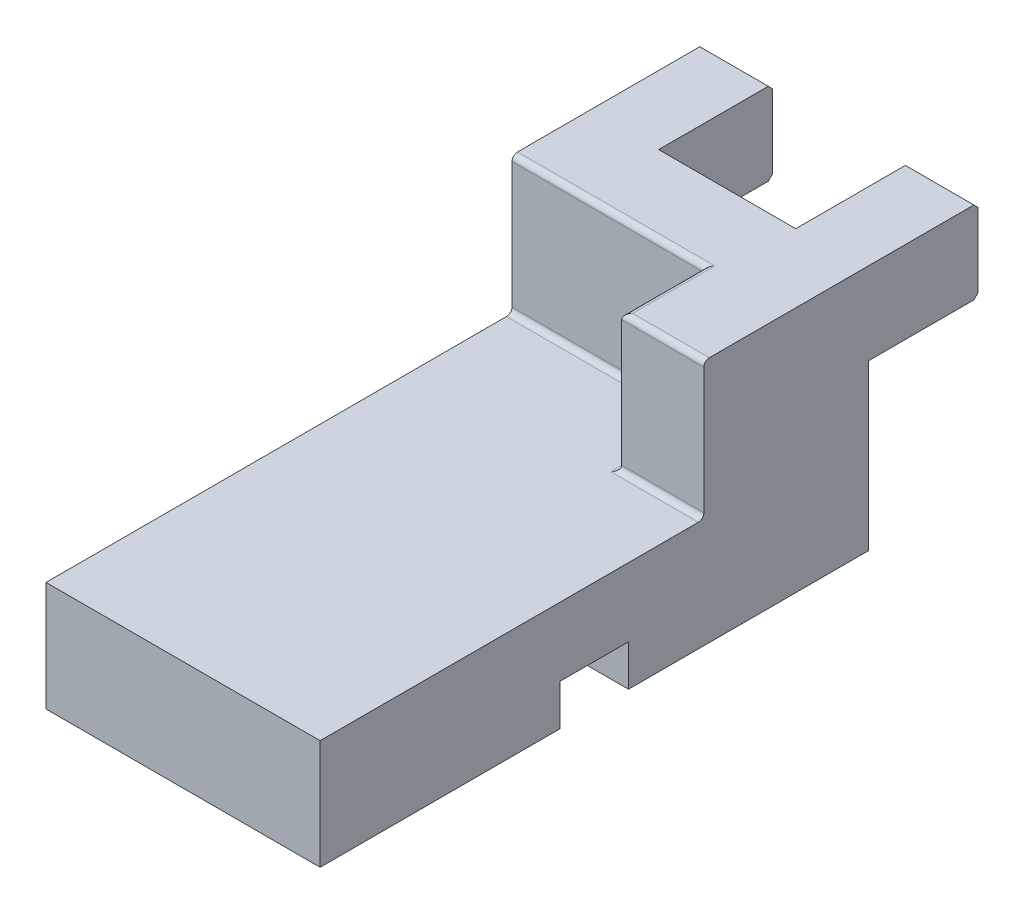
ISO-10303-21;
HEADER;
FILE_DESCRIPTION(('STEP AP214'),'2;1');
FILE_NAME('part.step','',(''),(''),'','','');
FILE_SCHEMA(('AUTOMOTIVE_DESIGN { 1 0 10303 214 1 1 1 1 }'));
ENDSEC;
DATA;
#1=APPLICATION_CONTEXT('core data for automotive mechanical design processes');
#2=APPLICATION_PROTOCOL_DEFINITION('international standard','automotive_design',2000,#1);
#3=PRODUCT_CONTEXT('',#1,'mechanical');
#4=PRODUCT('Part','Part','',(#3));
#5=PRODUCT_RELATED_PRODUCT_CATEGORY('part','',(#4));
#6=PRODUCT_DEFINITION_FORMATION('','',#4);
#7=PRODUCT_DEFINITION_CONTEXT('part definition',#1,'design');
#8=PRODUCT_DEFINITION('design','',#6,#7);
#9=PRODUCT_DEFINITION_SHAPE('','',#8);
#10=(LENGTH_UNIT() NAMED_UNIT(*) SI_UNIT(.MILLI.,.METRE.));
#11=(NAMED_UNIT(*) PLANE_ANGLE_UNIT() SI_UNIT($,.RADIAN.));
#12=(NAMED_UNIT(*) SI_UNIT($,.STERADIAN.) SOLID_ANGLE_UNIT());
#13=UNCERTAINTY_MEASURE_WITH_UNIT(LENGTH_MEASURE(1.E-05),#10,'distance_accuracy_value','');
#14=(GEOMETRIC_REPRESENTATION_CONTEXT(3) GLOBAL_UNCERTAINTY_ASSIGNED_CONTEXT((#13)) GLOBAL_UNIT_ASSIGNED_CONTEXT((#10,
#11,#12)) REPRESENTATION_CONTEXT('',''));
#15=CARTESIAN_POINT('',(0.,0.,0.));
#16=DIRECTION('',(0.,0.,1.));
#17=DIRECTION('',(1.,0.,0.));
#18=AXIS2_PLACEMENT_3D('',#15,#16,#17);
#19=CARTESIAN_POINT('',(50.,20.,-100.));
#20=DIRECTION('',(0.,0.,1.));
#21=DIRECTION('',(1.,0.,0.));
#22=AXIS2_PLACEMENT_3D('',#19,#20,#21);
#23=PLANE('',#22);
#24=DIRECTION('',(0.,-1.,0.));
#25=VECTOR('',#24,1.);
#26=CARTESIAN_POINT('',(-25.,70.,-100.));
#27=LINE('',#26,#25);
#28=CARTESIAN_POINT('',(-25.,68.5,-100.));
#29=VERTEX_POINT('',#28);
#30=CARTESIAN_POINT('',(-25.,40.,-100.));
#31=VERTEX_POINT('',#30);
#32=EDGE_CURVE('E224',#29,#31,#27,.T.);
#33=ORIENTED_EDGE('',*,*,#32,.F.);
#34=DIRECTION('',(1.,0.,0.));
#35=VECTOR('',#34,1.);
#36=CARTESIAN_POINT('',(50.,68.5,-100.));
#37=LINE('',#36,#35);
#38=CARTESIAN_POINT('',(25.,68.5,-100.));
#39=VERTEX_POINT('',#38);
#40=EDGE_CURVE('E384',#29,#39,#37,.T.);
#41=ORIENTED_EDGE('',*,*,#40,.T.);
#42=DIRECTION('',(0.,1.,0.));
#43=VECTOR('',#42,1.);
#44=CARTESIAN_POINT('',(25.,70.,-100.));
#45=LINE('',#44,#43);
#46=CARTESIAN_POINT('',(25.,40.,-100.));
#47=VERTEX_POINT('',#46);
#48=EDGE_CURVE('E248',#47,#39,#45,.T.);
#49=ORIENTED_EDGE('',*,*,#48,.F.);
#50=DIRECTION('',(-1.,0.,0.));
#51=VECTOR('',#50,1.);
#52=CARTESIAN_POINT('',(50.,40.,-100.));
#53=LINE('',#52,#51);
#54=CARTESIAN_POINT('',(50.,40.,-100.));
#55=VERTEX_POINT('',#54);
#56=EDGE_CURVE('E243',#55,#47,#53,.T.);
#57=ORIENTED_EDGE('',*,*,#56,.F.);
#58=DIRECTION('',(0.,1.,0.));
#59=VECTOR('',#58,1.);
#60=CARTESIAN_POINT('',(50.,20.,-100.));
#61=LINE('',#60,#59);
#62=CARTESIAN_POINT('',(50.,-20.,-100.));
#63=VERTEX_POINT('',#62);
#64=EDGE_CURVE('E300',#63,#55,#61,.T.);
#65=ORIENTED_EDGE('',*,*,#64,.F.);
#66=DIRECTION('',(-1.,0.,0.));
#67=VECTOR('',#66,1.);
#68=CARTESIAN_POINT('',(50.,-20.,-100.));
#69=LINE('',#68,#67);
#70=CARTESIAN_POINT('',(-50.,-20.,-100.));
#71=VERTEX_POINT('',#70);
#72=EDGE_CURVE('E312',#63,#71,#69,.T.);
#73=ORIENTED_EDGE('',*,*,#72,.T.);
#74=DIRECTION('',(0.,1.,0.));
#75=VECTOR('',#74,1.);
#76=CARTESIAN_POINT('',(-50.,20.,-100.));
#77=LINE('',#76,#75);
#78=CARTESIAN_POINT('',(-50.,40.,-100.));
#79=VERTEX_POINT('',#78);
#80=EDGE_CURVE('E233',#71,#79,#77,.T.);
#81=ORIENTED_EDGE('',*,*,#80,.T.);
#82=DIRECTION('',(-1.,0.,0.));
#83=VECTOR('',#82,1.);
#84=CARTESIAN_POINT('',(-50.,40.,-100.));
#85=LINE('',#84,#83);
#86=EDGE_CURVE('E216',#31,#79,#85,.T.);
#87=ORIENTED_EDGE('',*,*,#86,.F.);
#88=EDGE_LOOP('',(#33,#41,#49,#57,#65,#73,#81,#87));
#89=FACE_BOUND('',#88,.T.);
#90=ADVANCED_FACE('F34',(#89),#23,.F.);
#91=CARTESIAN_POINT('',(50.,20.,100.));
#92=DIRECTION('',(0.,-1.,0.));
#93=DIRECTION('',(0.,0.,-1.));
#94=AXIS2_PLACEMENT_3D('',#91,#92,#93);
#95=PLANE('',#94);
#96=DIRECTION('',(0.,0.,1.));
#97=VECTOR('',#96,1.);
#98=CARTESIAN_POINT('',(50.,20.,100.));
#99=LINE('',#98,#97);
#100=CARTESIAN_POINT('',(50.,20.,-38.));
#101=VERTEX_POINT('',#100);
#102=CARTESIAN_POINT('',(50.,20.,100.));
#103=VERTEX_POINT('',#102);
#104=EDGE_CURVE('E303',#101,#103,#99,.T.);
#105=ORIENTED_EDGE('',*,*,#104,.F.);
#106=DIRECTION('',(1.,0.,0.));
#107=VECTOR('',#106,1.);
#108=CARTESIAN_POINT('',(20.,20.,-38.));
#109=LINE('',#108,#107);
#110=CARTESIAN_POINT('',(18.,20.,-38.));
#111=VERTEX_POINT('',#110);
#112=EDGE_CURVE('E335',#101,#111,#109,.F.);
#113=ORIENTED_EDGE('',*,*,#112,.T.);
#114=DIRECTION('',(0.,0.,1.));
#115=VECTOR('',#114,1.);
#116=CARTESIAN_POINT('',(18.,20.,-70.));
#117=LINE('',#116,#115);
#118=CARTESIAN_POINT('',(18.,20.,-68.));
#119=VERTEX_POINT('',#118);
#120=EDGE_CURVE('E333',#111,#119,#117,.F.);
#121=ORIENTED_EDGE('',*,*,#120,.T.);
#122=DIRECTION('',(1.,0.,0.));
#123=VECTOR('',#122,1.);
#124=CARTESIAN_POINT('',(-50.,20.,-68.));
#125=LINE('',#124,#123);
#126=CARTESIAN_POINT('',(-50.,20.,-68.));
#127=VERTEX_POINT('',#126);
#128=EDGE_CURVE('E331',#119,#127,#125,.F.);
#129=ORIENTED_EDGE('',*,*,#128,.T.);
#130=DIRECTION('',(0.,0.,1.));
#131=VECTOR('',#130,1.);
#132=CARTESIAN_POINT('',(-50.,20.,100.));
#133=LINE('',#132,#131);
#134=CARTESIAN_POINT('',(-50.,20.,100.));
#135=VERTEX_POINT('',#134);
#136=EDGE_CURVE('E314',#127,#135,#133,.T.);
#137=ORIENTED_EDGE('',*,*,#136,.T.);
#138=DIRECTION('',(-1.,0.,0.));
#139=VECTOR('',#138,1.);
#140=CARTESIAN_POINT('',(50.,20.,100.));
#141=LINE('',#140,#139);
#142=EDGE_CURVE('E325',#103,#135,#141,.T.);
#143=ORIENTED_EDGE('',*,*,#142,.F.);
#144=EDGE_LOOP('',(#105,#113,#121,#129,#137,#143));
#145=FACE_BOUND('',#144,.T.);
#146=ADVANCED_FACE('F435',(#145),#95,.F.);
#147=CARTESIAN_POINT('',(50.,-20.,100.));
#148=DIRECTION('',(0.,1.,0.));
#149=DIRECTION('',(0.,0.,1.));
#150=AXIS2_PLACEMENT_3D('',#147,#148,#149);
#151=PLANE('',#150);
#152=DIRECTION('',(0.,0.,-1.));
#153=VECTOR('',#152,1.);
#154=CARTESIAN_POINT('',(-50.,-20.,100.));
#155=LINE('',#154,#153);
#156=CARTESIAN_POINT('',(-50.,-20.,100.));
#157=VERTEX_POINT('',#156);
#158=CARTESIAN_POINT('',(-50.,-20.,12.5));
#159=VERTEX_POINT('',#158);
#160=EDGE_CURVE('E304',#157,#159,#155,.T.);
#161=ORIENTED_EDGE('',*,*,#160,.T.);
#162=DIRECTION('',(1.,0.,0.));
#163=VECTOR('',#162,1.);
#164=CARTESIAN_POINT('',(-50.,-20.,12.5));
#165=LINE('',#164,#163);
#166=CARTESIAN_POINT('',(50.,-20.,12.5));
#167=VERTEX_POINT('',#166);
#168=EDGE_CURVE('E285',#159,#167,#165,.T.);
#169=ORIENTED_EDGE('',*,*,#168,.T.);
#170=DIRECTION('',(0.,0.,-1.));
#171=VECTOR('',#170,1.);
#172=CARTESIAN_POINT('',(50.,-20.,100.));
#173=LINE('',#172,#171);
#174=CARTESIAN_POINT('',(50.,-20.,100.));
#175=VERTEX_POINT('',#174);
#176=EDGE_CURVE('E309',#175,#167,#173,.T.);
#177=ORIENTED_EDGE('',*,*,#176,.F.);
#178=DIRECTION('',(-1.,0.,0.));
#179=VECTOR('',#178,1.);
#180=CARTESIAN_POINT('',(50.,-20.,100.));
#181=LINE('',#180,#179);
#182=EDGE_CURVE('E322',#175,#157,#181,.T.);
#183=ORIENTED_EDGE('',*,*,#182,.T.);
#184=EDGE_LOOP('',(#161,#169,#177,#183));
#185=FACE_BOUND('',#184,.T.);
#186=ADVANCED_FACE('F440',(#185),#151,.F.);
#187=CARTESIAN_POINT('',(50.,20.,100.));
#188=DIRECTION('',(0.,0.,-1.));
#189=DIRECTION('',(-1.,0.,0.));
#190=AXIS2_PLACEMENT_3D('',#187,#188,#189);
#191=PLANE('',#190);
#192=DIRECTION('',(0.,-1.,0.));
#193=VECTOR('',#192,1.);
#194=CARTESIAN_POINT('',(-50.,20.,100.));
#195=LINE('',#194,#193);
#196=EDGE_CURVE('E316',#135,#157,#195,.T.);
#197=ORIENTED_EDGE('',*,*,#196,.T.);
#198=ORIENTED_EDGE('',*,*,#182,.F.);
#199=DIRECTION('',(0.,-1.,0.));
#200=VECTOR('',#199,1.);
#201=CARTESIAN_POINT('',(50.,20.,100.));
#202=LINE('',#201,#200);
#203=EDGE_CURVE('E306',#103,#175,#202,.T.);
#204=ORIENTED_EDGE('',*,*,#203,.F.);
#205=ORIENTED_EDGE('',*,*,#142,.T.);
#206=EDGE_LOOP('',(#197,#198,#204,#205));
#207=FACE_BOUND('',#206,.T.);
#208=ADVANCED_FACE('F527',(#207),#191,.F.);
#209=CARTESIAN_POINT('',(50.,-20.,-12.5));
#210=VERTEX_POINT('',#209);
#211=EDGE_CURVE('E308',#210,#63,#173,.T.);
#212=ORIENTED_EDGE('',*,*,#211,.F.);
#213=DIRECTION('',(1.,0.,0.));
#214=VECTOR('',#213,1.);
#215=CARTESIAN_POINT('',(-50.,-20.,-12.5));
#216=LINE('',#215,#214);
#217=CARTESIAN_POINT('',(-50.,-20.,-12.5));
#218=VERTEX_POINT('',#217);
#219=EDGE_CURVE('E296',#218,#210,#216,.T.);
#220=ORIENTED_EDGE('',*,*,#219,.F.);
#221=EDGE_CURVE('E318',#218,#71,#155,.T.);
#222=ORIENTED_EDGE('',*,*,#221,.T.);
#223=ORIENTED_EDGE('',*,*,#72,.F.);
#224=EDGE_LOOP('',(#212,#220,#222,#223));
#225=FACE_BOUND('',#224,.T.);
#226=ADVANCED_FACE('F548',(#225),#151,.F.);
#227=CARTESIAN_POINT('',(50.,0.,0.));
#228=DIRECTION('',(1.,0.,0.));
#229=DIRECTION('',(0.,0.,-1.));
#230=AXIS2_PLACEMENT_3D('',#227,#228,#229);
#231=PLANE('',#230);
#232=DIRECTION('',(0.,0.,1.));
#233=VECTOR('',#232,1.);
#234=CARTESIAN_POINT('',(50.,40.,-140.));
#235=LINE('',#234,#233);
#236=CARTESIAN_POINT('',(50.,40.,-138.5));
#237=VERTEX_POINT('',#236);
#238=EDGE_CURVE('E259',#237,#55,#235,.T.);
#239=ORIENTED_EDGE('',*,*,#238,.F.);
#240=DIRECTION('',(0.,0.707106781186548,-0.707106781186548));
#241=VECTOR('',#240,1.);
#242=CARTESIAN_POINT('',(50.,-49.25,-49.25));
#243=LINE('',#242,#241);
#244=CARTESIAN_POINT('',(50.,41.5000000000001,-140.));
#245=VERTEX_POINT('',#244);
#246=EDGE_CURVE('E400',#237,#245,#243,.T.);
#247=ORIENTED_EDGE('',*,*,#246,.T.);
#248=DIRECTION('',(0.,-1.,0.));
#249=VECTOR('',#248,1.);
#250=CARTESIAN_POINT('',(50.,70.,-140.));
#251=LINE('',#250,#249);
#252=CARTESIAN_POINT('',(50.,68.5,-140.));
#253=VERTEX_POINT('',#252);
#254=EDGE_CURVE('E244',#253,#245,#251,.T.);
#255=ORIENTED_EDGE('',*,*,#254,.F.);
#256=DIRECTION('',(0.,0.707106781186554,0.707106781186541));
#257=VECTOR('',#256,1.);
#258=CARTESIAN_POINT('',(50.,104.249999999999,-104.250000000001));
#259=LINE('',#258,#257);
#260=CARTESIAN_POINT('',(50.,70.,-138.5));
#261=VERTEX_POINT('',#260);
#262=EDGE_CURVE('E398',#253,#261,#259,.T.);
#263=ORIENTED_EDGE('',*,*,#262,.T.);
#264=DIRECTION('',(0.,0.,-1.));
#265=VECTOR('',#264,1.);
#266=CARTESIAN_POINT('',(50.,70.,-100.));
#267=LINE('',#266,#265);
#268=CARTESIAN_POINT('',(50.,70.,-42.));
#269=VERTEX_POINT('',#268);
#270=EDGE_CURVE('E263',#269,#261,#267,.T.);
#271=ORIENTED_EDGE('',*,*,#270,.F.);
#272=CARTESIAN_POINT('',(50.,68.,-42.));
#273=DIRECTION('',(1.,0.,0.));
#274=DIRECTION('',(0.,0.,-1.));
#275=AXIS2_PLACEMENT_3D('',#272,#273,#274);
#276=CIRCLE('',#275,2.);
#277=CARTESIAN_POINT('',(50.,68.,-40.));
#278=VERTEX_POINT('',#277);
#279=EDGE_CURVE('E361',#269,#278,#276,.T.);
#280=ORIENTED_EDGE('',*,*,#279,.T.);
#281=DIRECTION('',(0.,-1.,0.));
#282=VECTOR('',#281,1.);
#283=CARTESIAN_POINT('',(50.,70.,-40.));
#284=LINE('',#283,#282);
#285=CARTESIAN_POINT('',(50.,22.,-40.));
#286=VERTEX_POINT('',#285);
#287=EDGE_CURVE('E266',#278,#286,#284,.T.);
#288=ORIENTED_EDGE('',*,*,#287,.T.);
#289=CARTESIAN_POINT('',(50.,22.,-38.));
#290=DIRECTION('',(1.,0.,0.));
#291=DIRECTION('',(0.,0.,-1.));
#292=AXIS2_PLACEMENT_3D('',#289,#290,#291);
#293=CIRCLE('',#292,2.);
#294=EDGE_CURVE('E343',#286,#101,#293,.F.);
#295=ORIENTED_EDGE('',*,*,#294,.T.);
#296=ORIENTED_EDGE('',*,*,#104,.T.);
#297=ORIENTED_EDGE('',*,*,#203,.T.);
#298=ORIENTED_EDGE('',*,*,#176,.T.);
#299=DIRECTION('',(0.,-1.,0.));
#300=VECTOR('',#299,1.);
#301=CARTESIAN_POINT('',(50.,-20.,12.5));
#302=LINE('',#301,#300);
#303=CARTESIAN_POINT('',(50.,-5.,12.5));
#304=VERTEX_POINT('',#303);
#305=EDGE_CURVE('E274',#304,#167,#302,.T.);
#306=ORIENTED_EDGE('',*,*,#305,.F.);
#307=DIRECTION('',(0.,0.,1.));
#308=VECTOR('',#307,1.);
#309=CARTESIAN_POINT('',(50.,-5.,12.5));
#310=LINE('',#309,#308);
#311=CARTESIAN_POINT('',(50.,-5.,-12.5));
#312=VERTEX_POINT('',#311);
#313=EDGE_CURVE('E279',#312,#304,#310,.T.);
#314=ORIENTED_EDGE('',*,*,#313,.F.);
#315=DIRECTION('',(0.,1.,0.));
#316=VECTOR('',#315,1.);
#317=CARTESIAN_POINT('',(50.,-20.,-12.5));
#318=LINE('',#317,#316);
#319=EDGE_CURVE('E287',#210,#312,#318,.T.);
#320=ORIENTED_EDGE('',*,*,#319,.F.);
#321=ORIENTED_EDGE('',*,*,#211,.T.);
#322=ORIENTED_EDGE('',*,*,#64,.T.);
#323=EDGE_LOOP('',(#239,#247,#255,#263,#271,#280,#288,#295,#296,#297,#298,#306,#314,#320,#321,#322));
#324=FACE_BOUND('',#323,.T.);
#325=ADVANCED_FACE('F496',(#324),#231,.T.);
#326=CARTESIAN_POINT('',(-50.,0.,0.));
#327=DIRECTION('',(1.,0.,0.));
#328=DIRECTION('',(0.,0.,-1.));
#329=AXIS2_PLACEMENT_3D('',#326,#327,#328);
#330=PLANE('',#329);
#331=DIRECTION('',(0.,1.,0.));
#332=VECTOR('',#331,1.);
#333=CARTESIAN_POINT('',(-50.,70.,-140.));
#334=LINE('',#333,#332);
#335=CARTESIAN_POINT('',(-50.,41.5000000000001,-140.));
#336=VERTEX_POINT('',#335);
#337=CARTESIAN_POINT('',(-50.,68.5,-140.));
#338=VERTEX_POINT('',#337);
#339=EDGE_CURVE('E234',#336,#338,#334,.T.);
#340=ORIENTED_EDGE('',*,*,#339,.F.);
#341=DIRECTION('',(0.,0.707106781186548,-0.707106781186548));
#342=VECTOR('',#341,1.);
#343=CARTESIAN_POINT('',(-50.,41.5000000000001,-140.));
#344=LINE('',#343,#342);
#345=CARTESIAN_POINT('',(-50.,40.,-138.5));
#346=VERTEX_POINT('',#345);
#347=EDGE_CURVE('E58',#336,#346,#344,.F.);
#348=ORIENTED_EDGE('',*,*,#347,.T.);
#349=DIRECTION('',(0.,0.,1.));
#350=VECTOR('',#349,1.);
#351=CARTESIAN_POINT('',(-50.,40.,-140.));
#352=LINE('',#351,#350);
#353=EDGE_CURVE('E221',#346,#79,#352,.T.);
#354=ORIENTED_EDGE('',*,*,#353,.T.);
#355=ORIENTED_EDGE('',*,*,#80,.F.);
#356=ORIENTED_EDGE('',*,*,#221,.F.);
#357=DIRECTION('',(0.,1.,0.));
#358=VECTOR('',#357,1.);
#359=CARTESIAN_POINT('',(-50.,-20.,-12.5));
#360=LINE('',#359,#358);
#361=CARTESIAN_POINT('',(-50.,-5.,-12.5));
#362=VERTEX_POINT('',#361);
#363=EDGE_CURVE('E278',#218,#362,#360,.T.);
#364=ORIENTED_EDGE('',*,*,#363,.T.);
#365=DIRECTION('',(0.,0.,1.));
#366=VECTOR('',#365,1.);
#367=CARTESIAN_POINT('',(-50.,-5.,12.5));
#368=LINE('',#367,#366);
#369=CARTESIAN_POINT('',(-50.,-5.,12.5));
#370=VERTEX_POINT('',#369);
#371=EDGE_CURVE('E282',#362,#370,#368,.T.);
#372=ORIENTED_EDGE('',*,*,#371,.T.);
#373=DIRECTION('',(0.,-1.,0.));
#374=VECTOR('',#373,1.);
#375=CARTESIAN_POINT('',(-50.,-20.,12.5));
#376=LINE('',#375,#374);
#377=EDGE_CURVE('E275',#370,#159,#376,.T.);
#378=ORIENTED_EDGE('',*,*,#377,.T.);
#379=ORIENTED_EDGE('',*,*,#160,.F.);
#380=ORIENTED_EDGE('',*,*,#196,.F.);
#381=ORIENTED_EDGE('',*,*,#136,.F.);
#382=CARTESIAN_POINT('',(-50.,22.,-68.));
#383=DIRECTION('',(1.,0.,0.));
#384=DIRECTION('',(0.,0.,-1.));
#385=AXIS2_PLACEMENT_3D('',#382,#383,#384);
#386=CIRCLE('',#385,2.);
#387=CARTESIAN_POINT('',(-50.,22.,-70.));
#388=VERTEX_POINT('',#387);
#389=EDGE_CURVE('E345',#127,#388,#386,.T.);
#390=ORIENTED_EDGE('',*,*,#389,.T.);
#391=DIRECTION('',(0.,-1.,0.));
#392=VECTOR('',#391,1.);
#393=CARTESIAN_POINT('',(-50.,70.,-70.));
#394=LINE('',#393,#392);
#395=CARTESIAN_POINT('',(-50.,68.,-70.));
#396=VERTEX_POINT('',#395);
#397=EDGE_CURVE('E272',#396,#388,#394,.T.);
#398=ORIENTED_EDGE('',*,*,#397,.F.);
#399=CARTESIAN_POINT('',(-50.,68.,-72.));
#400=DIRECTION('',(1.,0.,0.));
#401=DIRECTION('',(0.,0.,-1.));
#402=AXIS2_PLACEMENT_3D('',#399,#400,#401);
#403=CIRCLE('',#402,2.);
#404=CARTESIAN_POINT('',(-50.,70.,-72.));
#405=VERTEX_POINT('',#404);
#406=EDGE_CURVE('E369',#396,#405,#403,.F.);
#407=ORIENTED_EDGE('',*,*,#406,.T.);
#408=DIRECTION('',(0.,0.,1.));
#409=VECTOR('',#408,1.);
#410=CARTESIAN_POINT('',(-50.,70.,-70.));
#411=LINE('',#410,#409);
#412=CARTESIAN_POINT('',(-50.,70.,-138.5));
#413=VERTEX_POINT('',#412);
#414=EDGE_CURVE('E261',#413,#405,#411,.T.);
#415=ORIENTED_EDGE('',*,*,#414,.F.);
#416=DIRECTION('',(0.,0.707106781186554,0.707106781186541));
#417=VECTOR('',#416,1.);
#418=CARTESIAN_POINT('',(-50.,68.5,-140.));
#419=LINE('',#418,#417);
#420=EDGE_CURVE('E408',#413,#338,#419,.F.);
#421=ORIENTED_EDGE('',*,*,#420,.T.);
#422=EDGE_LOOP('',(#340,#348,#354,#355,#356,#364,#372,#378,#379,#380,#381,#390,#398,#407,#415,#421));
#423=FACE_BOUND('',#422,.T.);
#424=ADVANCED_FACE('F536',(#423),#330,.F.);
#425=CARTESIAN_POINT('',(-50.,-20.,12.5));
#426=DIRECTION('',(0.,0.,1.));
#427=DIRECTION('',(1.,0.,0.));
#428=AXIS2_PLACEMENT_3D('',#425,#426,#427);
#429=PLANE('',#428);
#430=ORIENTED_EDGE('',*,*,#305,.T.);
#431=ORIENTED_EDGE('',*,*,#168,.F.);
#432=ORIENTED_EDGE('',*,*,#377,.F.);
#433=DIRECTION('',(1.,0.,0.));
#434=VECTOR('',#433,1.);
#435=CARTESIAN_POINT('',(-50.,-5.,12.5));
#436=LINE('',#435,#434);
#437=EDGE_CURVE('E292',#370,#304,#436,.T.);
#438=ORIENTED_EDGE('',*,*,#437,.T.);
#439=EDGE_LOOP('',(#430,#431,#432,#438));
#440=FACE_BOUND('',#439,.T.);
#441=ADVANCED_FACE('F535',(#440),#429,.F.);
#442=CARTESIAN_POINT('',(-50.,-5.,12.5));
#443=DIRECTION('',(0.,1.,0.));
#444=DIRECTION('',(0.,0.,1.));
#445=AXIS2_PLACEMENT_3D('',#442,#443,#444);
#446=PLANE('',#445);
#447=ORIENTED_EDGE('',*,*,#313,.T.);
#448=ORIENTED_EDGE('',*,*,#437,.F.);
#449=ORIENTED_EDGE('',*,*,#371,.F.);
#450=DIRECTION('',(1.,0.,0.));
#451=VECTOR('',#450,1.);
#452=CARTESIAN_POINT('',(-50.,-5.,-12.5));
#453=LINE('',#452,#451);
#454=EDGE_CURVE('E294',#362,#312,#453,.T.);
#455=ORIENTED_EDGE('',*,*,#454,.T.);
#456=EDGE_LOOP('',(#447,#448,#449,#455));
#457=FACE_BOUND('',#456,.T.);
#458=ADVANCED_FACE('F540',(#457),#446,.F.);
#459=CARTESIAN_POINT('',(-50.,-20.,-12.5));
#460=DIRECTION('',(0.,0.,-1.));
#461=DIRECTION('',(-1.,0.,0.));
#462=AXIS2_PLACEMENT_3D('',#459,#460,#461);
#463=PLANE('',#462);
#464=ORIENTED_EDGE('',*,*,#319,.T.);
#465=ORIENTED_EDGE('',*,*,#454,.F.);
#466=ORIENTED_EDGE('',*,*,#363,.F.);
#467=ORIENTED_EDGE('',*,*,#219,.T.);
#468=EDGE_LOOP('',(#464,#465,#466,#467));
#469=FACE_BOUND('',#468,.T.);
#470=ADVANCED_FACE('F542',(#469),#463,.F.);
#471=CARTESIAN_POINT('',(20.,70.,-70.));
#472=DIRECTION('',(0.,0.,-1.));
#473=DIRECTION('',(-1.,0.,0.));
#474=AXIS2_PLACEMENT_3D('',#471,#472,#473);
#475=PLANE('',#474);
#476=DIRECTION('',(0.,-1.,0.));
#477=VECTOR('',#476,1.);
#478=CARTESIAN_POINT('',(20.,70.,-70.));
#479=LINE('',#478,#477);
#480=CARTESIAN_POINT('',(20.,68.,-70.));
#481=VERTEX_POINT('',#480);
#482=CARTESIAN_POINT('',(20.,22.,-70.));
#483=VERTEX_POINT('',#482);
#484=EDGE_CURVE('E270',#481,#483,#479,.T.);
#485=ORIENTED_EDGE('',*,*,#484,.F.);
#486=DIRECTION('',(1.,0.,0.));
#487=VECTOR('',#486,1.);
#488=CARTESIAN_POINT('',(20.,68.,-70.));
#489=LINE('',#488,#487);
#490=EDGE_CURVE('E367',#481,#396,#489,.F.);
#491=ORIENTED_EDGE('',*,*,#490,.T.);
#492=ORIENTED_EDGE('',*,*,#397,.T.);
#493=DIRECTION('',(1.,0.,0.));
#494=VECTOR('',#493,1.);
#495=CARTESIAN_POINT('',(20.,22.,-70.));
#496=LINE('',#495,#494);
#497=EDGE_CURVE('E340',#388,#483,#496,.T.);
#498=ORIENTED_EDGE('',*,*,#497,.T.);
#499=EDGE_LOOP('',(#485,#491,#492,#498));
#500=FACE_BOUND('',#499,.T.);
#501=ADVANCED_FACE('F573',(#500),#475,.F.);
#502=CARTESIAN_POINT('',(20.,70.,-40.));
#503=DIRECTION('',(1.,0.,0.));
#504=DIRECTION('',(0.,0.,-1.));
#505=AXIS2_PLACEMENT_3D('',#502,#503,#504);
#506=PLANE('',#505);
#507=DIRECTION('',(0.,-1.,0.));
#508=VECTOR('',#507,1.);
#509=CARTESIAN_POINT('',(20.,70.,-40.));
#510=LINE('',#509,#508);
#511=CARTESIAN_POINT('',(20.,68.,-40.));
#512=VERTEX_POINT('',#511);
#513=CARTESIAN_POINT('',(20.,22.,-40.));
#514=VERTEX_POINT('',#513);
#515=EDGE_CURVE('E268',#512,#514,#510,.T.);
#516=ORIENTED_EDGE('',*,*,#515,.F.);
#517=DIRECTION('',(0.,0.,1.));
#518=VECTOR('',#517,1.);
#519=CARTESIAN_POINT('',(20.,68.,-40.));
#520=LINE('',#519,#518);
#521=EDGE_CURVE('E365',#512,#481,#520,.F.);
#522=ORIENTED_EDGE('',*,*,#521,.T.);
#523=ORIENTED_EDGE('',*,*,#484,.T.);
#524=DIRECTION('',(0.,0.,1.));
#525=VECTOR('',#524,1.);
#526=CARTESIAN_POINT('',(20.,22.,-40.));
#527=LINE('',#526,#525);
#528=EDGE_CURVE('E337',#483,#514,#527,.T.);
#529=ORIENTED_EDGE('',*,*,#528,.T.);
#530=EDGE_LOOP('',(#516,#522,#523,#529));
#531=FACE_BOUND('',#530,.T.);
#532=ADVANCED_FACE('F571',(#531),#506,.F.);
#533=CARTESIAN_POINT('',(50.,70.,-40.));
#534=DIRECTION('',(0.,0.,-1.));
#535=DIRECTION('',(-1.,0.,0.));
#536=AXIS2_PLACEMENT_3D('',#533,#534,#535);
#537=PLANE('',#536);
#538=ORIENTED_EDGE('',*,*,#287,.F.);
#539=DIRECTION('',(1.,0.,0.));
#540=VECTOR('',#539,1.);
#541=CARTESIAN_POINT('',(50.,68.,-40.));
#542=LINE('',#541,#540);
#543=EDGE_CURVE('E363',#278,#512,#542,.F.);
#544=ORIENTED_EDGE('',*,*,#543,.T.);
#545=ORIENTED_EDGE('',*,*,#515,.T.);
#546=DIRECTION('',(1.,0.,0.));
#547=VECTOR('',#546,1.);
#548=CARTESIAN_POINT('',(50.,22.,-40.));
#549=LINE('',#548,#547);
#550=EDGE_CURVE('E328',#514,#286,#549,.T.);
#551=ORIENTED_EDGE('',*,*,#550,.T.);
#552=EDGE_LOOP('',(#538,#544,#545,#551));
#553=FACE_BOUND('',#552,.T.);
#554=ADVANCED_FACE('F514',(#553),#537,.F.);
#555=CARTESIAN_POINT('',(0.,70.,0.));
#556=DIRECTION('',(0.,-1.,0.));
#557=DIRECTION('',(0.,0.,-1.));
#558=AXIS2_PLACEMENT_3D('',#555,#556,#557);
#559=PLANE('',#558);
#560=DIRECTION('',(-1.,0.,0.));
#561=VECTOR('',#560,1.);
#562=CARTESIAN_POINT('',(0.,70.,-98.5));
#563=LINE('',#562,#561);
#564=CARTESIAN_POINT('',(25.,70.,-98.5));
#565=VERTEX_POINT('',#564);
#566=CARTESIAN_POINT('',(-25.,70.,-98.5));
#567=VERTEX_POINT('',#566);
#568=EDGE_CURVE('E381',#565,#567,#563,.T.);
#569=ORIENTED_EDGE('',*,*,#568,.T.);
#570=DIRECTION('',(0.,0.,1.));
#571=VECTOR('',#570,1.);
#572=CARTESIAN_POINT('',(-25.,70.,-140.));
#573=LINE('',#572,#571);
#574=CARTESIAN_POINT('',(-25.,70.,-138.5));
#575=VERTEX_POINT('',#574);
#576=EDGE_CURVE('E220',#575,#567,#573,.T.);
#577=ORIENTED_EDGE('',*,*,#576,.F.);
#578=DIRECTION('',(-1.,0.,0.));
#579=VECTOR('',#578,1.);
#580=CARTESIAN_POINT('',(0.,70.,-138.5));
#581=LINE('',#580,#579);
#582=EDGE_CURVE('E372',#575,#413,#581,.T.);
#583=ORIENTED_EDGE('',*,*,#582,.T.);
#584=ORIENTED_EDGE('',*,*,#414,.T.);
#585=DIRECTION('',(1.,0.,0.));
#586=VECTOR('',#585,1.);
#587=CARTESIAN_POINT('',(0.,70.,-72.));
#588=LINE('',#587,#586);
#589=CARTESIAN_POINT('',(22.,70.,-72.));
#590=VERTEX_POINT('',#589);
#591=EDGE_CURVE('E348',#405,#590,#588,.T.);
#592=ORIENTED_EDGE('',*,*,#591,.T.);
#593=DIRECTION('',(0.,0.,1.));
#594=VECTOR('',#593,1.);
#595=CARTESIAN_POINT('',(22.,70.,0.));
#596=LINE('',#595,#594);
#597=CARTESIAN_POINT('',(22.,70.,-42.));
#598=VERTEX_POINT('',#597);
#599=EDGE_CURVE('E356',#590,#598,#596,.T.);
#600=ORIENTED_EDGE('',*,*,#599,.T.);
#601=DIRECTION('',(1.,0.,0.));
#602=VECTOR('',#601,1.);
#603=CARTESIAN_POINT('',(0.,70.,-42.));
#604=LINE('',#603,#602);
#605=EDGE_CURVE('E358',#598,#269,#604,.T.);
#606=ORIENTED_EDGE('',*,*,#605,.T.);
#607=ORIENTED_EDGE('',*,*,#270,.T.);
#608=DIRECTION('',(-1.,0.,0.));
#609=VECTOR('',#608,1.);
#610=CARTESIAN_POINT('',(25.,70.,-138.5));
#611=LINE('',#610,#609);
#612=CARTESIAN_POINT('',(25.,70.,-138.5));
#613=VERTEX_POINT('',#612);
#614=EDGE_CURVE('E379',#261,#613,#611,.T.);
#615=ORIENTED_EDGE('',*,*,#614,.T.);
#616=DIRECTION('',(0.,0.,1.));
#617=VECTOR('',#616,1.);
#618=CARTESIAN_POINT('',(25.,70.,-140.));
#619=LINE('',#618,#617);
#620=EDGE_CURVE('E251',#613,#565,#619,.T.);
#621=ORIENTED_EDGE('',*,*,#620,.T.);
#622=EDGE_LOOP('',(#569,#577,#583,#584,#592,#600,#606,#607,#615,#621));
#623=FACE_BOUND('',#622,.T.);
#624=ADVANCED_FACE('F505',(#623),#559,.F.);
#625=CARTESIAN_POINT('',(50.,40.,-140.));
#626=DIRECTION('',(0.,1.,0.));
#627=DIRECTION('',(0.,0.,1.));
#628=AXIS2_PLACEMENT_3D('',#625,#626,#627);
#629=PLANE('',#628);
#630=DIRECTION('',(0.,0.,1.));
#631=VECTOR('',#630,1.);
#632=CARTESIAN_POINT('',(25.,40.,-140.));
#633=LINE('',#632,#631);
#634=CARTESIAN_POINT('',(25.,40.,-138.5));
#635=VERTEX_POINT('',#634);
#636=EDGE_CURVE('E257',#635,#47,#633,.T.);
#637=ORIENTED_EDGE('',*,*,#636,.F.);
#638=DIRECTION('',(1.,0.,0.));
#639=VECTOR('',#638,1.);
#640=CARTESIAN_POINT('',(50.,40.,-138.5));
#641=LINE('',#640,#639);
#642=EDGE_CURVE('E396',#635,#237,#641,.T.);
#643=ORIENTED_EDGE('',*,*,#642,.T.);
#644=ORIENTED_EDGE('',*,*,#238,.T.);
#645=ORIENTED_EDGE('',*,*,#56,.T.);
#646=EDGE_LOOP('',(#637,#643,#644,#645));
#647=FACE_BOUND('',#646,.T.);
#648=ADVANCED_FACE('F554',(#647),#629,.F.);
#649=CARTESIAN_POINT('',(25.,70.,-140.));
#650=DIRECTION('',(1.,0.,0.));
#651=DIRECTION('',(0.,1.,0.));
#652=AXIS2_PLACEMENT_3D('',#649,#650,#651);
#653=PLANE('',#652);
#654=DIRECTION('',(0.,1.,0.));
#655=VECTOR('',#654,1.);
#656=CARTESIAN_POINT('',(25.,70.,-140.));
#657=LINE('',#656,#655);
#658=CARTESIAN_POINT('',(25.,41.5000000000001,-140.));
#659=VERTEX_POINT('',#658);
#660=CARTESIAN_POINT('',(25.,68.5,-140.));
#661=VERTEX_POINT('',#660);
#662=EDGE_CURVE('E247',#659,#661,#657,.T.);
#663=ORIENTED_EDGE('',*,*,#662,.F.);
#664=DIRECTION('',(0.,-0.707106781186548,0.707106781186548));
#665=VECTOR('',#664,1.);
#666=CARTESIAN_POINT('',(25.,41.5000000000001,-140.));
#667=LINE('',#666,#665);
#668=EDGE_CURVE('E394',#659,#635,#667,.T.);
#669=ORIENTED_EDGE('',*,*,#668,.T.);
#670=ORIENTED_EDGE('',*,*,#636,.T.);
#671=ORIENTED_EDGE('',*,*,#48,.T.);
#672=DIRECTION('',(0.,-0.707106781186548,-0.707106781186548));
#673=VECTOR('',#672,1.);
#674=CARTESIAN_POINT('',(25.,49.25,-119.25));
#675=LINE('',#674,#673);
#676=EDGE_CURVE('E11',#39,#565,#675,.F.);
#677=ORIENTED_EDGE('',*,*,#676,.T.);
#678=ORIENTED_EDGE('',*,*,#620,.F.);
#679=DIRECTION('',(0.,-0.707106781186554,-0.707106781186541));
#680=VECTOR('',#679,1.);
#681=CARTESIAN_POINT('',(25.,68.5,-140.));
#682=LINE('',#681,#680);
#683=EDGE_CURVE('E392',#613,#661,#682,.T.);
#684=ORIENTED_EDGE('',*,*,#683,.T.);
#685=EDGE_LOOP('',(#663,#669,#670,#671,#677,#678,#684));
#686=FACE_BOUND('',#685,.T.);
#687=ADVANCED_FACE('F556',(#686),#653,.F.);
#688=CARTESIAN_POINT('',(0.,0.,-140.));
#689=DIRECTION('',(0.,0.,-1.));
#690=DIRECTION('',(-1.,0.,0.));
#691=AXIS2_PLACEMENT_3D('',#688,#689,#690);
#692=PLANE('',#691);
#693=ORIENTED_EDGE('',*,*,#254,.T.);
#694=DIRECTION('',(-1.,0.,0.));
#695=VECTOR('',#694,1.);
#696=CARTESIAN_POINT('',(25.,41.5000000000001,-140.));
#697=LINE('',#696,#695);
#698=EDGE_CURVE('E389',#245,#659,#697,.T.);
#699=ORIENTED_EDGE('',*,*,#698,.T.);
#700=ORIENTED_EDGE('',*,*,#662,.T.);
#701=DIRECTION('',(1.,0.,0.));
#702=VECTOR('',#701,1.);
#703=CARTESIAN_POINT('',(50.,68.5,-140.));
#704=LINE('',#703,#702);
#705=EDGE_CURVE('E386',#661,#253,#704,.T.);
#706=ORIENTED_EDGE('',*,*,#705,.T.);
#707=EDGE_LOOP('',(#693,#699,#700,#706));
#708=FACE_BOUND('',#707,.T.);
#709=ADVANCED_FACE('F498',(#708),#692,.T.);
#710=CARTESIAN_POINT('',(-25.,70.,-140.));
#711=DIRECTION('',(-1.,0.,0.));
#712=DIRECTION('',(0.,-1.,0.));
#713=AXIS2_PLACEMENT_3D('',#710,#711,#712);
#714=PLANE('',#713);
#715=DIRECTION('',(0.,0.,1.));
#716=VECTOR('',#715,1.);
#717=CARTESIAN_POINT('',(-25.,40.,-140.));
#718=LINE('',#717,#716);
#719=CARTESIAN_POINT('',(-25.,40.,-138.5));
#720=VERTEX_POINT('',#719);
#721=EDGE_CURVE('E212',#720,#31,#718,.T.);
#722=ORIENTED_EDGE('',*,*,#721,.F.);
#723=DIRECTION('',(0.,-0.707106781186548,0.707106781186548));
#724=VECTOR('',#723,1.);
#725=CARTESIAN_POINT('',(-25.,41.5000000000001,-140.));
#726=LINE('',#725,#724);
#727=CARTESIAN_POINT('',(-25.,41.5000000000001,-140.));
#728=VERTEX_POINT('',#727);
#729=EDGE_CURVE('E414',#720,#728,#726,.F.);
#730=ORIENTED_EDGE('',*,*,#729,.T.);
#731=DIRECTION('',(0.,-1.,0.));
#732=VECTOR('',#731,1.);
#733=CARTESIAN_POINT('',(-25.,70.,-140.));
#734=LINE('',#733,#732);
#735=CARTESIAN_POINT('',(-25.,68.5,-140.));
#736=VERTEX_POINT('',#735);
#737=EDGE_CURVE('E237',#736,#728,#734,.T.);
#738=ORIENTED_EDGE('',*,*,#737,.F.);
#739=DIRECTION('',(0.,-0.707106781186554,-0.707106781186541));
#740=VECTOR('',#739,1.);
#741=CARTESIAN_POINT('',(-25.,68.5,-140.));
#742=LINE('',#741,#740);
#743=EDGE_CURVE('E412',#736,#575,#742,.F.);
#744=ORIENTED_EDGE('',*,*,#743,.T.);
#745=ORIENTED_EDGE('',*,*,#576,.T.);
#746=DIRECTION('',(0.,0.707106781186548,0.707106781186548));
#747=VECTOR('',#746,1.);
#748=CARTESIAN_POINT('',(-25.,49.25,-119.25));
#749=LINE('',#748,#747);
#750=EDGE_CURVE('E43',#567,#29,#749,.F.);
#751=ORIENTED_EDGE('',*,*,#750,.T.);
#752=ORIENTED_EDGE('',*,*,#32,.T.);
#753=EDGE_LOOP('',(#722,#730,#738,#744,#745,#751,#752));
#754=FACE_BOUND('',#753,.T.);
#755=ADVANCED_FACE('F225',(#754),#714,.F.);
#756=CARTESIAN_POINT('',(-50.,40.,-140.));
#757=DIRECTION('',(0.,1.,0.));
#758=DIRECTION('',(0.,0.,1.));
#759=AXIS2_PLACEMENT_3D('',#756,#757,#758);
#760=PLANE('',#759);
#761=ORIENTED_EDGE('',*,*,#353,.F.);
#762=DIRECTION('',(1.,0.,0.));
#763=VECTOR('',#762,1.);
#764=CARTESIAN_POINT('',(-50.,40.,-138.5));
#765=LINE('',#764,#763);
#766=EDGE_CURVE('E50',#346,#720,#765,.T.);
#767=ORIENTED_EDGE('',*,*,#766,.T.);
#768=ORIENTED_EDGE('',*,*,#721,.T.);
#769=ORIENTED_EDGE('',*,*,#86,.T.);
#770=EDGE_LOOP('',(#761,#767,#768,#769));
#771=FACE_BOUND('',#770,.T.);
#772=ADVANCED_FACE('F214',(#771),#760,.F.);
#773=CARTESIAN_POINT('',(0.,0.,-140.));
#774=DIRECTION('',(0.,0.,1.));
#775=DIRECTION('',(1.,0.,0.));
#776=AXIS2_PLACEMENT_3D('',#773,#774,#775);
#777=PLANE('',#776);
#778=ORIENTED_EDGE('',*,*,#737,.T.);
#779=DIRECTION('',(-1.,0.,0.));
#780=VECTOR('',#779,1.);
#781=CARTESIAN_POINT('',(0.,41.5000000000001,-140.));
#782=LINE('',#781,#780);
#783=EDGE_CURVE('E405',#728,#336,#782,.T.);
#784=ORIENTED_EDGE('',*,*,#783,.T.);
#785=ORIENTED_EDGE('',*,*,#339,.T.);
#786=DIRECTION('',(1.,0.,0.));
#787=VECTOR('',#786,1.);
#788=CARTESIAN_POINT('',(0.,68.5,-140.));
#789=LINE('',#788,#787);
#790=EDGE_CURVE('E402',#338,#736,#789,.T.);
#791=ORIENTED_EDGE('',*,*,#790,.T.);
#792=EDGE_LOOP('',(#778,#784,#785,#791));
#793=FACE_BOUND('',#792,.T.);
#794=ADVANCED_FACE('F420',(#793),#777,.F.);
#795=CARTESIAN_POINT('',(20.,22.,-68.));
#796=DIRECTION('',(-1.,0.,0.));
#797=DIRECTION('',(0.,0.,1.));
#798=AXIS2_PLACEMENT_3D('',#795,#796,#797);
#799=CYLINDRICAL_SURFACE('',#798,2.);
#800=ORIENTED_EDGE('',*,*,#389,.F.);
#801=ORIENTED_EDGE('',*,*,#128,.F.);
#802=CARTESIAN_POINT('',(18.,22.,-68.));
#803=DIRECTION('',(-0.707106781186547,0.,-0.707106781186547));
#804=DIRECTION('',(0.707106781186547,0.,-0.707106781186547));
#805=AXIS2_PLACEMENT_3D('',#802,#803,#804);
#806=ELLIPSE('',#805,2.82842712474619,2.);
#807=EDGE_CURVE('E229',#483,#119,#806,.T.);
#808=ORIENTED_EDGE('',*,*,#807,.F.);
#809=ORIENTED_EDGE('',*,*,#497,.F.);
#810=EDGE_LOOP('',(#800,#801,#808,#809));
#811=FACE_BOUND('',#810,.T.);
#812=ADVANCED_FACE('F453',(#811),#799,.F.);
#813=CARTESIAN_POINT('',(18.,22.,-40.));
#814=DIRECTION('',(0.,0.,-1.));
#815=DIRECTION('',(-1.,0.,0.));
#816=AXIS2_PLACEMENT_3D('',#813,#814,#815);
#817=CYLINDRICAL_SURFACE('',#816,2.);
#818=ORIENTED_EDGE('',*,*,#807,.T.);
#819=ORIENTED_EDGE('',*,*,#120,.F.);
#820=CARTESIAN_POINT('',(18.,22.,-38.));
#821=DIRECTION('',(-0.707106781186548,0.,-0.707106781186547));
#822=DIRECTION('',(0.707106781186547,0.,-0.707106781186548));
#823=AXIS2_PLACEMENT_3D('',#820,#821,#822);
#824=ELLIPSE('',#823,2.82842712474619,2.);
#825=EDGE_CURVE('E349',#514,#111,#824,.T.);
#826=ORIENTED_EDGE('',*,*,#825,.F.);
#827=ORIENTED_EDGE('',*,*,#528,.F.);
#828=EDGE_LOOP('',(#818,#819,#826,#827));
#829=FACE_BOUND('',#828,.T.);
#830=ADVANCED_FACE('F449',(#829),#817,.F.);
#831=CARTESIAN_POINT('',(50.,22.,-38.));
#832=DIRECTION('',(-1.,0.,0.));
#833=DIRECTION('',(0.,0.,1.));
#834=AXIS2_PLACEMENT_3D('',#831,#832,#833);
#835=CYLINDRICAL_SURFACE('',#834,2.);
#836=ORIENTED_EDGE('',*,*,#825,.T.);
#837=ORIENTED_EDGE('',*,*,#112,.F.);
#838=ORIENTED_EDGE('',*,*,#294,.F.);
#839=ORIENTED_EDGE('',*,*,#550,.F.);
#840=EDGE_LOOP('',(#836,#837,#838,#839));
#841=FACE_BOUND('',#840,.T.);
#842=ADVANCED_FACE('F445',(#841),#835,.F.);
#843=CARTESIAN_POINT('',(0.,68.,-72.));
#844=DIRECTION('',(1.,0.,0.));
#845=DIRECTION('',(0.,0.,-1.));
#846=AXIS2_PLACEMENT_3D('',#843,#844,#845);
#847=CYLINDRICAL_SURFACE('',#846,2.);
#848=ORIENTED_EDGE('',*,*,#406,.F.);
#849=ORIENTED_EDGE('',*,*,#490,.F.);
#850=CARTESIAN_POINT('',(22.,68.,-72.));
#851=DIRECTION('',(0.707106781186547,0.,0.707106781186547));
#852=DIRECTION('',(-0.707106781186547,0.,0.707106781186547));
#853=AXIS2_PLACEMENT_3D('',#850,#851,#852);
#854=ELLIPSE('',#853,2.82842712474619,2.);
#855=EDGE_CURVE('E352',#590,#481,#854,.T.);
#856=ORIENTED_EDGE('',*,*,#855,.F.);
#857=ORIENTED_EDGE('',*,*,#591,.F.);
#858=EDGE_LOOP('',(#848,#849,#856,#857));
#859=FACE_BOUND('',#858,.T.);
#860=ADVANCED_FACE('F448',(#859),#847,.T.);
#861=CARTESIAN_POINT('',(22.,68.,0.));
#862=DIRECTION('',(0.,0.,1.));
#863=DIRECTION('',(1.,0.,0.));
#864=AXIS2_PLACEMENT_3D('',#861,#862,#863);
#865=CYLINDRICAL_SURFACE('',#864,2.);
#866=ORIENTED_EDGE('',*,*,#855,.T.);
#867=ORIENTED_EDGE('',*,*,#521,.F.);
#868=CARTESIAN_POINT('',(22.,68.,-42.));
#869=DIRECTION('',(0.707106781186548,0.,0.707106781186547));
#870=DIRECTION('',(-0.707106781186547,0.,0.707106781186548));
#871=AXIS2_PLACEMENT_3D('',#868,#869,#870);
#872=ELLIPSE('',#871,2.82842712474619,2.);
#873=EDGE_CURVE('E373',#598,#512,#872,.T.);
#874=ORIENTED_EDGE('',*,*,#873,.F.);
#875=ORIENTED_EDGE('',*,*,#599,.F.);
#876=EDGE_LOOP('',(#866,#867,#874,#875));
#877=FACE_BOUND('',#876,.T.);
#878=ADVANCED_FACE('F462',(#877),#865,.T.);
#879=CARTESIAN_POINT('',(0.,68.,-42.));
#880=DIRECTION('',(1.,0.,0.));
#881=DIRECTION('',(0.,0.,-1.));
#882=AXIS2_PLACEMENT_3D('',#879,#880,#881);
#883=CYLINDRICAL_SURFACE('',#882,2.);
#884=ORIENTED_EDGE('',*,*,#873,.T.);
#885=ORIENTED_EDGE('',*,*,#543,.F.);
#886=ORIENTED_EDGE('',*,*,#279,.F.);
#887=ORIENTED_EDGE('',*,*,#605,.F.);
#888=EDGE_LOOP('',(#884,#885,#886,#887));
#889=FACE_BOUND('',#888,.T.);
#890=ADVANCED_FACE('F458',(#889),#883,.T.);
#891=CARTESIAN_POINT('',(0.,70.,-98.5));
#892=DIRECTION('',(0.,-0.707106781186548,0.707106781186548));
#893=DIRECTION('',(-1.,0.,0.));
#894=AXIS2_PLACEMENT_3D('',#891,#892,#893);
#895=PLANE('',#894);
#896=ORIENTED_EDGE('',*,*,#676,.F.);
#897=ORIENTED_EDGE('',*,*,#40,.F.);
#898=ORIENTED_EDGE('',*,*,#750,.F.);
#899=ORIENTED_EDGE('',*,*,#568,.F.);
#900=EDGE_LOOP('',(#896,#897,#898,#899));
#901=FACE_BOUND('',#900,.T.);
#902=ADVANCED_FACE('F461',(#901),#895,.F.);
#903=CARTESIAN_POINT('',(0.,41.5000000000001,-140.));
#904=DIRECTION('',(0.,-0.707106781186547,-0.707106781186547));
#905=DIRECTION('',(1.,0.,0.));
#906=AXIS2_PLACEMENT_3D('',#903,#904,#905);
#907=PLANE('',#906);
#908=ORIENTED_EDGE('',*,*,#246,.F.);
#909=ORIENTED_EDGE('',*,*,#642,.F.);
#910=ORIENTED_EDGE('',*,*,#668,.F.);
#911=ORIENTED_EDGE('',*,*,#698,.F.);
#912=EDGE_LOOP('',(#908,#909,#910,#911));
#913=FACE_BOUND('',#912,.T.);
#914=ADVANCED_FACE('F430',(#913),#907,.T.);
#915=CARTESIAN_POINT('',(0.,68.5,-140.));
#916=DIRECTION('',(0.,0.707106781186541,-0.707106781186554));
#917=DIRECTION('',(-1.,0.,0.));
#918=AXIS2_PLACEMENT_3D('',#915,#916,#917);
#919=PLANE('',#918);
#920=ORIENTED_EDGE('',*,*,#683,.F.);
#921=ORIENTED_EDGE('',*,*,#614,.F.);
#922=ORIENTED_EDGE('',*,*,#262,.F.);
#923=ORIENTED_EDGE('',*,*,#705,.F.);
#924=EDGE_LOOP('',(#920,#921,#922,#923));
#925=FACE_BOUND('',#924,.T.);
#926=ADVANCED_FACE('F424',(#925),#919,.T.);
#927=CARTESIAN_POINT('',(0.,41.5000000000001,-140.));
#928=DIRECTION('',(0.,0.707106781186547,0.707106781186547));
#929=DIRECTION('',(-1.,0.,0.));
#930=AXIS2_PLACEMENT_3D('',#927,#928,#929);
#931=PLANE('',#930);
#932=ORIENTED_EDGE('',*,*,#729,.F.);
#933=ORIENTED_EDGE('',*,*,#766,.F.);
#934=ORIENTED_EDGE('',*,*,#347,.F.);
#935=ORIENTED_EDGE('',*,*,#783,.F.);
#936=EDGE_LOOP('',(#932,#933,#934,#935));
#937=FACE_BOUND('',#936,.T.);
#938=ADVANCED_FACE('F422',(#937),#931,.F.);
#939=CARTESIAN_POINT('',(0.,68.5,-140.));
#940=DIRECTION('',(0.,-0.707106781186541,0.707106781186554));
#941=DIRECTION('',(1.,0.,0.));
#942=AXIS2_PLACEMENT_3D('',#939,#940,#941);
#943=PLANE('',#942);
#944=ORIENTED_EDGE('',*,*,#420,.F.);
#945=ORIENTED_EDGE('',*,*,#582,.F.);
#946=ORIENTED_EDGE('',*,*,#743,.F.);
#947=ORIENTED_EDGE('',*,*,#790,.F.);
#948=EDGE_LOOP('',(#944,#945,#946,#947));
#949=FACE_BOUND('',#948,.T.);
#950=ADVANCED_FACE('F37',(#949),#943,.F.);
#951=CLOSED_SHELL('',(#90,#146,#186,#208,#226,#325,#424,#441,#458,#470,#501,#532,#554,#624,#648,
#687,#709,#755,#772,#794,#812,#830,#842,#860,#878,#890,#902,#914,#926,#938,#950));
#952=MANIFOLD_SOLID_BREP('B2',#951);
#953=ADVANCED_BREP_SHAPE_REPRESENTATION('',(#18,#952),#14);
#954=SHAPE_DEFINITION_REPRESENTATION(#9,#953);
ENDSEC;
END-ISO-10303-21;
